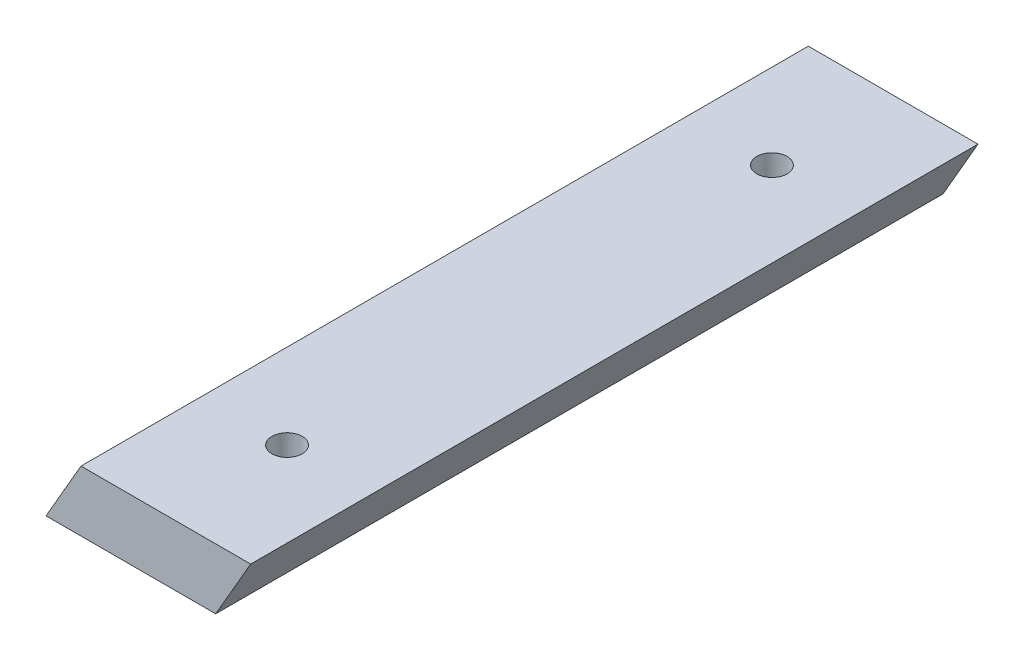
from build123d import *

# Parameters (mm, degrees)
BOSS_EXTRUDE1_DEPTH = 60
SKETCH2_R           = 2.5
CUT_EXTRUDE1_DEPTH  = 64.960858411


with BuildPart() as part:
    # Sketch1 → Boss-Extrude1 (new, symmetric)
    with BuildSketch(Plane.XY):
        Polygon((-14, 5), (-19.773502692, -5), (-14, -5), align=None)
        Polygon((8.226497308, -5), (14, 5), (-14, 5), (-14, -5), align=None)
    extrude(amount=BOSS_EXTRUDE1_DEPTH, both=True)

    # Sketch2 → Cut-Extrude1 (cut, through all)
    with BuildSketch(Plane(origin=(0, 5, 0), x_dir=(1, 0, 0), z_dir=(0, 1, 0))):
        with Locations(Location((0, -40, 0), (0, 0, 180))):
            Circle(SKETCH2_R)
    cut_extrude1 = extrude(amount=-CUT_EXTRUDE1_DEPTH, mode=Mode.SUBTRACT)

    # Mirror1: Cut-Extrude1 across plane
    add(cut_extrude1.mirror(Plane.XY), mode=Mode.SUBTRACT)


solid = part.part
